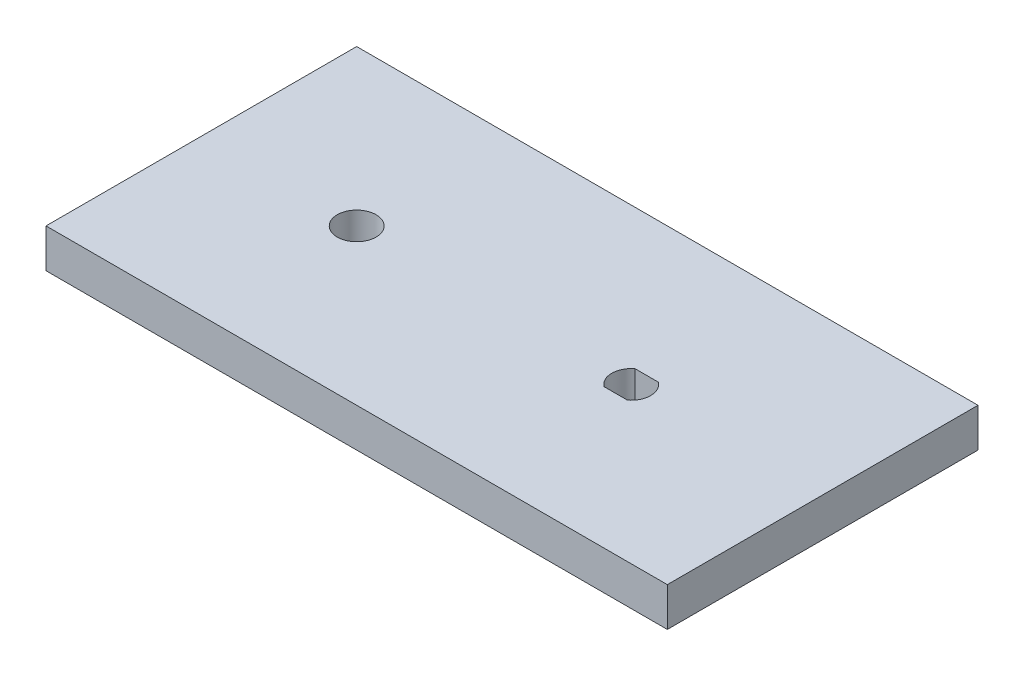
ISO-10303-21;
HEADER;
FILE_DESCRIPTION(('STEP AP214'),'2;1');
FILE_NAME('part.step','',(''),(''),'','','');
FILE_SCHEMA(('AUTOMOTIVE_DESIGN { 1 0 10303 214 1 1 1 1 }'));
ENDSEC;
DATA;
#1=APPLICATION_CONTEXT('core data for automotive mechanical design processes');
#2=APPLICATION_PROTOCOL_DEFINITION('international standard','automotive_design',2000,#1);
#3=PRODUCT_CONTEXT('',#1,'mechanical');
#4=PRODUCT('Part','Part','',(#3));
#5=PRODUCT_RELATED_PRODUCT_CATEGORY('part','',(#4));
#6=PRODUCT_DEFINITION_FORMATION('','',#4);
#7=PRODUCT_DEFINITION_CONTEXT('part definition',#1,'design');
#8=PRODUCT_DEFINITION('design','',#6,#7);
#9=PRODUCT_DEFINITION_SHAPE('','',#8);
#10=(LENGTH_UNIT() NAMED_UNIT(*) SI_UNIT(.MILLI.,.METRE.));
#11=(NAMED_UNIT(*) PLANE_ANGLE_UNIT() SI_UNIT($,.RADIAN.));
#12=(NAMED_UNIT(*) SI_UNIT($,.STERADIAN.) SOLID_ANGLE_UNIT());
#13=UNCERTAINTY_MEASURE_WITH_UNIT(LENGTH_MEASURE(1.E-05),#10,'distance_accuracy_value','');
#14=(GEOMETRIC_REPRESENTATION_CONTEXT(3) GLOBAL_UNCERTAINTY_ASSIGNED_CONTEXT((#13)) GLOBAL_UNIT_ASSIGNED_CONTEXT((#10,
#11,#12)) REPRESENTATION_CONTEXT('',''));
#15=CARTESIAN_POINT('',(0.,0.,0.));
#16=DIRECTION('',(0.,0.,1.));
#17=DIRECTION('',(1.,0.,0.));
#18=AXIS2_PLACEMENT_3D('',#15,#16,#17);
#19=CARTESIAN_POINT('',(0.,10.,0.));
#20=DIRECTION('',(1.,0.,0.));
#21=DIRECTION('',(0.,0.,-1.));
#22=AXIS2_PLACEMENT_3D('',#19,#20,#21);
#23=PLANE('',#22);
#24=DIRECTION('',(0.,0.,1.));
#25=VECTOR('',#24,1.);
#26=CARTESIAN_POINT('',(0.,0.,0.));
#27=LINE('',#26,#25);
#28=CARTESIAN_POINT('',(0.,0.,-80.));
#29=VERTEX_POINT('',#28);
#30=CARTESIAN_POINT('',(0.,0.,0.));
#31=VERTEX_POINT('',#30);
#32=EDGE_CURVE('E135',#29,#31,#27,.T.);
#33=ORIENTED_EDGE('',*,*,#32,.T.);
#34=DIRECTION('',(0.,-1.,0.));
#35=VECTOR('',#34,1.);
#36=CARTESIAN_POINT('',(0.,10.,0.));
#37=LINE('',#36,#35);
#38=CARTESIAN_POINT('',(0.,10.,0.));
#39=VERTEX_POINT('',#38);
#40=EDGE_CURVE('E11',#39,#31,#37,.T.);
#41=ORIENTED_EDGE('',*,*,#40,.F.);
#42=DIRECTION('',(0.,0.,1.));
#43=VECTOR('',#42,1.);
#44=CARTESIAN_POINT('',(0.,10.,0.));
#45=LINE('',#44,#43);
#46=CARTESIAN_POINT('',(0.,10.,-80.));
#47=VERTEX_POINT('',#46);
#48=EDGE_CURVE('E138',#47,#39,#45,.T.);
#49=ORIENTED_EDGE('',*,*,#48,.F.);
#50=DIRECTION('',(0.,-1.,0.));
#51=VECTOR('',#50,1.);
#52=CARTESIAN_POINT('',(0.,10.,-80.));
#53=LINE('',#52,#51);
#54=EDGE_CURVE('E148',#47,#29,#53,.T.);
#55=ORIENTED_EDGE('',*,*,#54,.T.);
#56=EDGE_LOOP('',(#33,#41,#49,#55));
#57=FACE_BOUND('',#56,.T.);
#58=ADVANCED_FACE('F31',(#57),#23,.F.);
#59=CARTESIAN_POINT('',(0.,10.,0.));
#60=DIRECTION('',(0.,0.,-1.));
#61=DIRECTION('',(-1.,0.,0.));
#62=AXIS2_PLACEMENT_3D('',#59,#60,#61);
#63=PLANE('',#62);
#64=DIRECTION('',(1.,0.,0.));
#65=VECTOR('',#64,1.);
#66=CARTESIAN_POINT('',(0.,0.,0.));
#67=LINE('',#66,#65);
#68=CARTESIAN_POINT('',(160.,0.,0.));
#69=VERTEX_POINT('',#68);
#70=EDGE_CURVE('E151',#31,#69,#67,.T.);
#71=ORIENTED_EDGE('',*,*,#70,.T.);
#72=DIRECTION('',(0.,-1.,0.));
#73=VECTOR('',#72,1.);
#74=CARTESIAN_POINT('',(160.,10.,0.));
#75=LINE('',#74,#73);
#76=CARTESIAN_POINT('',(160.,10.,0.));
#77=VERTEX_POINT('',#76);
#78=EDGE_CURVE('E38',#77,#69,#75,.T.);
#79=ORIENTED_EDGE('',*,*,#78,.F.);
#80=DIRECTION('',(1.,0.,0.));
#81=VECTOR('',#80,1.);
#82=CARTESIAN_POINT('',(0.,10.,0.));
#83=LINE('',#82,#81);
#84=EDGE_CURVE('E141',#39,#77,#83,.T.);
#85=ORIENTED_EDGE('',*,*,#84,.F.);
#86=ORIENTED_EDGE('',*,*,#40,.T.);
#87=EDGE_LOOP('',(#71,#79,#85,#86));
#88=FACE_BOUND('',#87,.T.);
#89=ADVANCED_FACE('F180',(#88),#63,.F.);
#90=CARTESIAN_POINT('',(160.,10.,0.));
#91=DIRECTION('',(-1.,0.,0.));
#92=DIRECTION('',(0.,0.,1.));
#93=AXIS2_PLACEMENT_3D('',#90,#91,#92);
#94=PLANE('',#93);
#95=DIRECTION('',(0.,0.,-1.));
#96=VECTOR('',#95,1.);
#97=CARTESIAN_POINT('',(160.,0.,0.));
#98=LINE('',#97,#96);
#99=CARTESIAN_POINT('',(160.,0.,-80.));
#100=VERTEX_POINT('',#99);
#101=EDGE_CURVE('E153',#69,#100,#98,.T.);
#102=ORIENTED_EDGE('',*,*,#101,.T.);
#103=DIRECTION('',(0.,-1.,0.));
#104=VECTOR('',#103,1.);
#105=CARTESIAN_POINT('',(160.,10.,-80.));
#106=LINE('',#105,#104);
#107=CARTESIAN_POINT('',(160.,10.,-80.));
#108=VERTEX_POINT('',#107);
#109=EDGE_CURVE('E158',#108,#100,#106,.T.);
#110=ORIENTED_EDGE('',*,*,#109,.F.);
#111=DIRECTION('',(0.,0.,-1.));
#112=VECTOR('',#111,1.);
#113=CARTESIAN_POINT('',(160.,10.,0.));
#114=LINE('',#113,#112);
#115=EDGE_CURVE('E144',#77,#108,#114,.T.);
#116=ORIENTED_EDGE('',*,*,#115,.F.);
#117=ORIENTED_EDGE('',*,*,#78,.T.);
#118=EDGE_LOOP('',(#102,#110,#116,#117));
#119=FACE_BOUND('',#118,.T.);
#120=ADVANCED_FACE('F165',(#119),#94,.F.);
#121=CARTESIAN_POINT('',(0.,10.,-80.));
#122=DIRECTION('',(0.,0.,1.));
#123=DIRECTION('',(1.,0.,0.));
#124=AXIS2_PLACEMENT_3D('',#121,#122,#123);
#125=PLANE('',#124);
#126=DIRECTION('',(-1.,0.,0.));
#127=VECTOR('',#126,1.);
#128=CARTESIAN_POINT('',(0.,0.,-80.));
#129=LINE('',#128,#127);
#130=EDGE_CURVE('E142',#100,#29,#129,.T.);
#131=ORIENTED_EDGE('',*,*,#130,.T.);
#132=ORIENTED_EDGE('',*,*,#54,.F.);
#133=DIRECTION('',(-1.,0.,0.));
#134=VECTOR('',#133,1.);
#135=CARTESIAN_POINT('',(0.,10.,-80.));
#136=LINE('',#135,#134);
#137=EDGE_CURVE('E146',#108,#47,#136,.T.);
#138=ORIENTED_EDGE('',*,*,#137,.F.);
#139=ORIENTED_EDGE('',*,*,#109,.T.);
#140=EDGE_LOOP('',(#131,#132,#138,#139));
#141=FACE_BOUND('',#140,.T.);
#142=ADVANCED_FACE('F173',(#141),#125,.F.);
#143=CARTESIAN_POINT('',(0.,10.,-80.));
#144=DIRECTION('',(0.,-1.,0.));
#145=DIRECTION('',(0.,0.,-1.));
#146=AXIS2_PLACEMENT_3D('',#143,#144,#145);
#147=PLANE('',#146);
#148=DIRECTION('',(1.,0.,0.));
#149=VECTOR('',#148,1.);
#150=CARTESIAN_POINT('',(113.7,10.,-36.));
#151=LINE('',#150,#149);
#152=CARTESIAN_POINT('',(107.7,10.,-36.));
#153=VERTEX_POINT('',#152);
#154=CARTESIAN_POINT('',(113.7,10.,-36.));
#155=VERTEX_POINT('',#154);
#156=EDGE_CURVE('E122',#153,#155,#151,.T.);
#157=ORIENTED_EDGE('',*,*,#156,.F.);
#158=CARTESIAN_POINT('',(110.7,10.,-40.));
#159=DIRECTION('',(0.,1.,0.));
#160=DIRECTION('',(0.,0.,1.));
#161=AXIS2_PLACEMENT_3D('',#158,#159,#160);
#162=CIRCLE('',#161,5.);
#163=CARTESIAN_POINT('',(107.7,10.,-44.));
#164=VERTEX_POINT('',#163);
#165=EDGE_CURVE('E45',#164,#153,#162,.T.);
#166=ORIENTED_EDGE('',*,*,#165,.F.);
#167=DIRECTION('',(-1.,0.,0.));
#168=VECTOR('',#167,1.);
#169=CARTESIAN_POINT('',(107.7,10.,-44.));
#170=LINE('',#169,#168);
#171=CARTESIAN_POINT('',(113.7,10.,-44.));
#172=VERTEX_POINT('',#171);
#173=EDGE_CURVE('E113',#172,#164,#170,.T.);
#174=ORIENTED_EDGE('',*,*,#173,.F.);
#175=CARTESIAN_POINT('',(110.7,10.,-40.));
#176=DIRECTION('',(0.,1.,0.));
#177=DIRECTION('',(0.,0.,1.));
#178=AXIS2_PLACEMENT_3D('',#175,#176,#177);
#179=CIRCLE('',#178,5.);
#180=EDGE_CURVE('E116',#155,#172,#179,.T.);
#181=ORIENTED_EDGE('',*,*,#180,.F.);
#182=EDGE_LOOP('',(#157,#166,#174,#181));
#183=FACE_BOUND('',#182,.T.);
#184=CARTESIAN_POINT('',(40.,10.,-40.));
#185=DIRECTION('',(0.,1.,0.));
#186=DIRECTION('',(0.,0.,1.));
#187=AXIS2_PLACEMENT_3D('',#184,#185,#186);
#188=CIRCLE('',#187,5.);
#189=CARTESIAN_POINT('',(40.,10.,-35.));
#190=VERTEX_POINT('',#189);
#191=EDGE_CURVE('E128',#190,#190,#188,.T.);
#192=ORIENTED_EDGE('',*,*,#191,.F.);
#193=EDGE_LOOP('',(#192));
#194=FACE_BOUND('',#193,.T.);
#195=ORIENTED_EDGE('',*,*,#48,.T.);
#196=ORIENTED_EDGE('',*,*,#84,.T.);
#197=ORIENTED_EDGE('',*,*,#115,.T.);
#198=ORIENTED_EDGE('',*,*,#137,.T.);
#199=EDGE_LOOP('',(#195,#196,#197,#198));
#200=FACE_BOUND('',#199,.T.);
#201=ADVANCED_FACE('F179',(#183,#194,#200),#147,.F.);
#202=CARTESIAN_POINT('',(0.,0.,-80.));
#203=DIRECTION('',(0.,-1.,0.));
#204=DIRECTION('',(0.,0.,-1.));
#205=AXIS2_PLACEMENT_3D('',#202,#203,#204);
#206=PLANE('',#205);
#207=CARTESIAN_POINT('',(110.7,0.,-40.));
#208=DIRECTION('',(0.,1.,0.));
#209=DIRECTION('',(0.,0.,1.));
#210=AXIS2_PLACEMENT_3D('',#207,#208,#209);
#211=CIRCLE('',#210,5.);
#212=CARTESIAN_POINT('',(107.7,0.,-44.));
#213=VERTEX_POINT('',#212);
#214=CARTESIAN_POINT('',(107.7,0.,-36.));
#215=VERTEX_POINT('',#214);
#216=EDGE_CURVE('E97',#213,#215,#211,.T.);
#217=ORIENTED_EDGE('',*,*,#216,.T.);
#218=DIRECTION('',(1.,0.,0.));
#219=VECTOR('',#218,1.);
#220=CARTESIAN_POINT('',(113.7,0.,-36.));
#221=LINE('',#220,#219);
#222=CARTESIAN_POINT('',(113.7,0.,-36.));
#223=VERTEX_POINT('',#222);
#224=EDGE_CURVE('E106',#215,#223,#221,.T.);
#225=ORIENTED_EDGE('',*,*,#224,.T.);
#226=CARTESIAN_POINT('',(110.7,0.,-40.));
#227=DIRECTION('',(0.,1.,0.));
#228=DIRECTION('',(0.,0.,1.));
#229=AXIS2_PLACEMENT_3D('',#226,#227,#228);
#230=CIRCLE('',#229,5.);
#231=CARTESIAN_POINT('',(113.7,0.,-44.));
#232=VERTEX_POINT('',#231);
#233=EDGE_CURVE('E53',#223,#232,#230,.T.);
#234=ORIENTED_EDGE('',*,*,#233,.T.);
#235=DIRECTION('',(-1.,0.,0.));
#236=VECTOR('',#235,1.);
#237=CARTESIAN_POINT('',(107.7,0.,-44.));
#238=LINE('',#237,#236);
#239=EDGE_CURVE('E103',#232,#213,#238,.T.);
#240=ORIENTED_EDGE('',*,*,#239,.T.);
#241=EDGE_LOOP('',(#217,#225,#234,#240));
#242=FACE_BOUND('',#241,.T.);
#243=CARTESIAN_POINT('',(40.,0.,-40.));
#244=DIRECTION('',(0.,1.,0.));
#245=DIRECTION('',(0.,0.,1.));
#246=AXIS2_PLACEMENT_3D('',#243,#244,#245);
#247=CIRCLE('',#246,5.);
#248=CARTESIAN_POINT('',(40.,0.,-35.));
#249=VERTEX_POINT('',#248);
#250=EDGE_CURVE('E132',#249,#249,#247,.T.);
#251=ORIENTED_EDGE('',*,*,#250,.T.);
#252=EDGE_LOOP('',(#251));
#253=FACE_BOUND('',#252,.T.);
#254=ORIENTED_EDGE('',*,*,#32,.F.);
#255=ORIENTED_EDGE('',*,*,#130,.F.);
#256=ORIENTED_EDGE('',*,*,#101,.F.);
#257=ORIENTED_EDGE('',*,*,#70,.F.);
#258=EDGE_LOOP('',(#254,#255,#256,#257));
#259=FACE_BOUND('',#258,.T.);
#260=ADVANCED_FACE('F110',(#242,#253,#259),#206,.T.);
#261=CARTESIAN_POINT('',(40.,0.,-40.));
#262=DIRECTION('',(0.,1.,0.));
#263=DIRECTION('',(0.,0.,1.));
#264=AXIS2_PLACEMENT_3D('',#261,#262,#263);
#265=CYLINDRICAL_SURFACE('',#264,5.);
#266=ORIENTED_EDGE('',*,*,#250,.F.);
#267=EDGE_LOOP('',(#266));
#268=FACE_BOUND('',#267,.T.);
#269=ORIENTED_EDGE('',*,*,#191,.T.);
#270=EDGE_LOOP('',(#269));
#271=FACE_BOUND('',#270,.T.);
#272=ADVANCED_FACE('F192',(#268,#271),#265,.F.);
#273=CARTESIAN_POINT('',(110.7,0.,-40.));
#274=DIRECTION('',(0.,1.,0.));
#275=DIRECTION('',(0.,0.,1.));
#276=AXIS2_PLACEMENT_3D('',#273,#274,#275);
#277=CYLINDRICAL_SURFACE('',#276,5.);
#278=ORIENTED_EDGE('',*,*,#165,.T.);
#279=DIRECTION('',(0.,1.,0.));
#280=VECTOR('',#279,1.);
#281=CARTESIAN_POINT('',(107.7,0.,-36.));
#282=LINE('',#281,#280);
#283=EDGE_CURVE('E93',#215,#153,#282,.T.);
#284=ORIENTED_EDGE('',*,*,#283,.F.);
#285=ORIENTED_EDGE('',*,*,#216,.F.);
#286=DIRECTION('',(0.,1.,0.));
#287=VECTOR('',#286,1.);
#288=CARTESIAN_POINT('',(107.7,0.,-44.));
#289=LINE('',#288,#287);
#290=EDGE_CURVE('E126',#213,#164,#289,.T.);
#291=ORIENTED_EDGE('',*,*,#290,.T.);
#292=EDGE_LOOP('',(#278,#284,#285,#291));
#293=FACE_BOUND('',#292,.T.);
#294=ADVANCED_FACE('F95',(#293),#277,.F.);
#295=CARTESIAN_POINT('',(107.7,0.,-44.));
#296=DIRECTION('',(0.,0.,-1.));
#297=DIRECTION('',(-1.,0.,0.));
#298=AXIS2_PLACEMENT_3D('',#295,#296,#297);
#299=PLANE('',#298);
#300=ORIENTED_EDGE('',*,*,#173,.T.);
#301=ORIENTED_EDGE('',*,*,#290,.F.);
#302=ORIENTED_EDGE('',*,*,#239,.F.);
#303=DIRECTION('',(0.,1.,0.));
#304=VECTOR('',#303,1.);
#305=CARTESIAN_POINT('',(113.7,0.,-44.));
#306=LINE('',#305,#304);
#307=EDGE_CURVE('E129',#232,#172,#306,.T.);
#308=ORIENTED_EDGE('',*,*,#307,.T.);
#309=EDGE_LOOP('',(#300,#301,#302,#308));
#310=FACE_BOUND('',#309,.T.);
#311=ADVANCED_FACE('F201',(#310),#299,.F.);
#312=CARTESIAN_POINT('',(110.7,0.,-40.));
#313=DIRECTION('',(0.,1.,0.));
#314=DIRECTION('',(0.,0.,1.));
#315=AXIS2_PLACEMENT_3D('',#312,#313,#314);
#316=CYLINDRICAL_SURFACE('',#315,5.);
#317=ORIENTED_EDGE('',*,*,#180,.T.);
#318=ORIENTED_EDGE('',*,*,#307,.F.);
#319=ORIENTED_EDGE('',*,*,#233,.F.);
#320=DIRECTION('',(0.,1.,0.));
#321=VECTOR('',#320,1.);
#322=CARTESIAN_POINT('',(113.7,0.,-36.));
#323=LINE('',#322,#321);
#324=EDGE_CURVE('E102',#223,#155,#323,.T.);
#325=ORIENTED_EDGE('',*,*,#324,.T.);
#326=EDGE_LOOP('',(#317,#318,#319,#325));
#327=FACE_BOUND('',#326,.T.);
#328=ADVANCED_FACE('F204',(#327),#316,.F.);
#329=CARTESIAN_POINT('',(113.7,0.,-36.));
#330=DIRECTION('',(0.,0.,1.));
#331=DIRECTION('',(1.,0.,0.));
#332=AXIS2_PLACEMENT_3D('',#329,#330,#331);
#333=PLANE('',#332);
#334=ORIENTED_EDGE('',*,*,#156,.T.);
#335=ORIENTED_EDGE('',*,*,#324,.F.);
#336=ORIENTED_EDGE('',*,*,#224,.F.);
#337=ORIENTED_EDGE('',*,*,#283,.T.);
#338=EDGE_LOOP('',(#334,#335,#336,#337));
#339=FACE_BOUND('',#338,.T.);
#340=ADVANCED_FACE('F107',(#339),#333,.F.);
#341=CLOSED_SHELL('',(#58,#89,#120,#142,#201,#260,#272,#294,#311,#328,#340));
#342=MANIFOLD_SOLID_BREP('B2',#341);
#343=ADVANCED_BREP_SHAPE_REPRESENTATION('',(#18,#342),#14);
#344=SHAPE_DEFINITION_REPRESENTATION(#9,#343);
ENDSEC;
END-ISO-10303-21;
